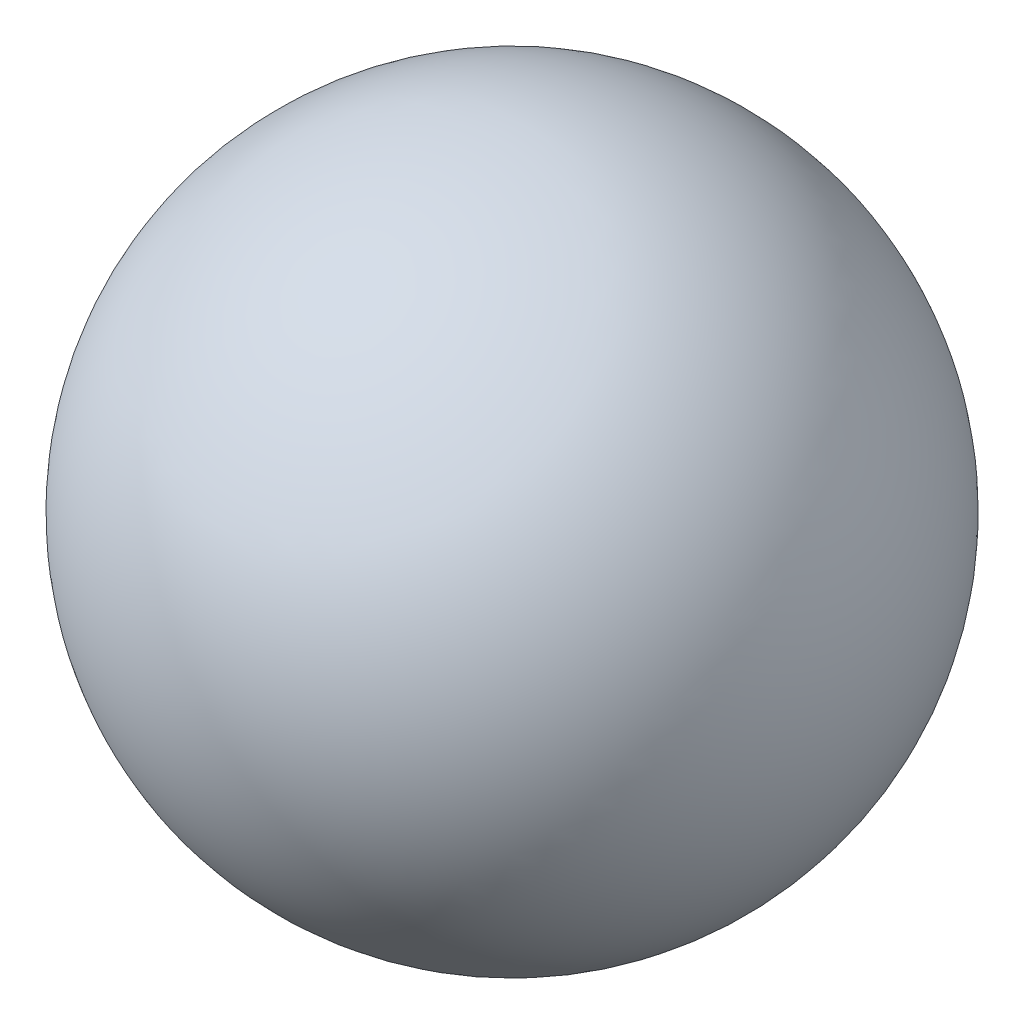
from build123d import *


with BuildPart() as part:
    # Sketch1 → Revolve1 (revolve)
    with BuildSketch(Plane(origin=(0, 0, 0), x_dir=(1, 0, 0), z_dir=(0, 1, 0))):
        with BuildLine():
            Line((0, 2), (0, -2))
            ThreePointArc((0, -2), (2, 0), (0, 2))
        make_face()
    revolve(axis=Axis((0, 0, -2), (0, 0, 1)))


solid = part.part
